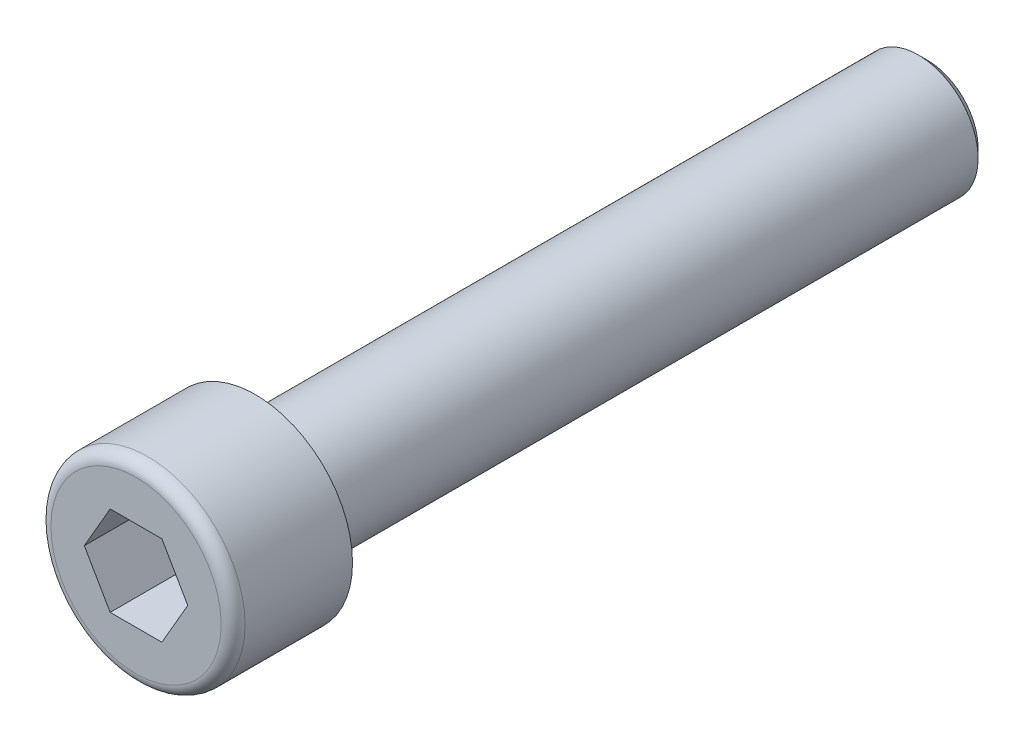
from build123d import *

# Parameters (mm, degrees)
ENL_V_MAT_EXTRU_1_DEPTH      = 5
ENL_V_MAT_EXTRU_1_DEPTH_BACK = 5


with BuildPart() as part:
    # Esquisse1 → R_volution1 (revolve)
    with BuildSketch(Plane(origin=(0, 0, 0), x_dir=(0, 0, -1), z_dir=(1, 0, 0)), mode=Mode.PRIVATE) as r_volution1_sk:
        with BuildLine():
            Line((-8, 0), (-8, 5.7))
            ThreePointArc((-8, 5.7), (-7.765685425, 6.265685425), (-7.2, 6.5))
            Line((-7.2, 6.5), (0, 6.5))
            Line((0, 6.5), (0, 4))
            Line((0, 4), (44.4, 4))
            Line((44.4, 4), (45, 3.4))
            Line((45, 3.4), (45, 0))
            Line((45, 0), (-8, 0))
        make_face()
    revolve(r_volution1_sk.sketch.rotate(Axis((0, 0, -45), (0, 0, 1)), 90), axis=Axis((0, 0, -45), (0, 0, 1)))

    # Esquisse2 → Enl_v. mat.-Extru.1 (cut, two sides: drawn at the far end of the back side and taken through both)
    with BuildSketch(Plane.XY.offset(8).offset(-ENL_V_MAT_EXTRU_1_DEPTH_BACK)):
        Polygon((-1.732050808, -3), (1.732050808, -3), (3.464101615, 0), (1.732050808, 3), (-1.732050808, 3), (-3.464101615, 0), align=None)
    extrude(amount=ENL_V_MAT_EXTRU_1_DEPTH + ENL_V_MAT_EXTRU_1_DEPTH_BACK, mode=Mode.SUBTRACT)


solid = part.part
